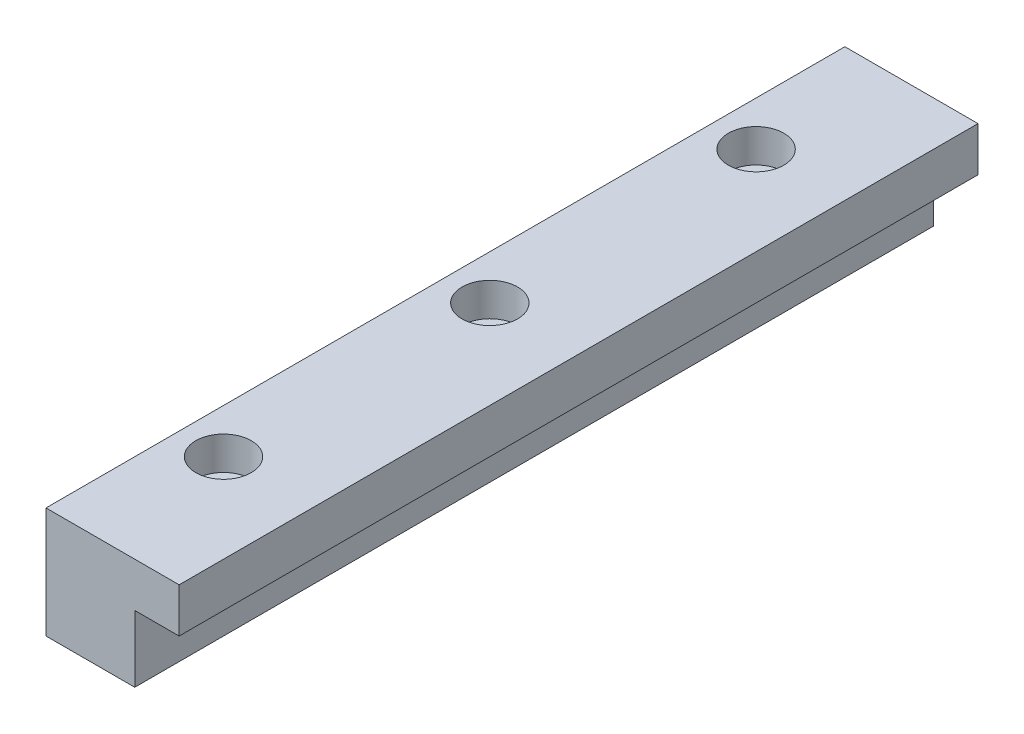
from build123d import *

# Parameters (mm, degrees)
EXTRUDE1_DEPTH                                    = 114.3
CBORE_FOR_5_8_SOCKET_HEAD_CAP_SCREW_E_D           = 10.0838
CBORE_FOR_5_8_SOCKET_HEAD_CAP_SCREW_E_CBORE_D     = 15.875
CBORE_FOR_5_8_SOCKET_HEAD_CAP_SCREW_E_CBORE_DEPTH = 9.525
CBORE_FOR_5_8_SOCKET_HEAD_CAP_SCREW_G_D           = 10.0838
CBORE_FOR_5_8_SOCKET_HEAD_CAP_SCREW_G_CBORE_D     = 15.875
CBORE_FOR_5_8_SOCKET_HEAD_CAP_SCREW_G_CBORE_DEPTH = 9.525
CBORE_FOR_5_8_SOCKET_HEAD_CAP_SCREW_K_D           = 10.0838
CBORE_FOR_5_8_SOCKET_HEAD_CAP_SCREW_K_CBORE_D     = 15.875
CBORE_FOR_5_8_SOCKET_HEAD_CAP_SCREW_K_CBORE_DEPTH = 9.525


with BuildPart() as part:
    # Sketch1 → Extrude1 (new, symmetric)
    with BuildSketch(Plane.XY):
        Polygon((-19.05, -15.875), (-19.05, 15.875), (19.05, 15.875), (19.05, 3.175), (6.35, 3.175), (6.35, -15.875), align=None)
    extrude(amount=EXTRUDE1_DEPTH, both=True)

    # CBORE for 5_8 Socket Head Cap Screw_E (through all)
    with Locations(Plane(origin=(-6.35, 15.875, 76.2), x_dir=(0, 0, 1), z_dir=(0, 1, 0))):
        with Locations((0, 0)):
            CounterBoreHole(CBORE_FOR_5_8_SOCKET_HEAD_CAP_SCREW_E_D / 2, CBORE_FOR_5_8_SOCKET_HEAD_CAP_SCREW_E_CBORE_D / 2, CBORE_FOR_5_8_SOCKET_HEAD_CAP_SCREW_E_CBORE_DEPTH)

    # CBORE for 5_8 Socket Head Cap Screw_G (through all)
    with Locations(Plane(origin=(-6.35, 15.875, 0), x_dir=(0, 0, 1), z_dir=(0, 1, 0))):
        with Locations((0, 0)):
            CounterBoreHole(CBORE_FOR_5_8_SOCKET_HEAD_CAP_SCREW_G_D / 2, CBORE_FOR_5_8_SOCKET_HEAD_CAP_SCREW_G_CBORE_D / 2, CBORE_FOR_5_8_SOCKET_HEAD_CAP_SCREW_G_CBORE_DEPTH)

    # CBORE for 5_8 Socket Head Cap Screw_K (through all)
    with Locations(Plane(origin=(-6.35, 15.875, -76.2), x_dir=(0, 0, 1), z_dir=(0, 1, 0))):
        with Locations((0, 0)):
            CounterBoreHole(CBORE_FOR_5_8_SOCKET_HEAD_CAP_SCREW_K_D / 2, CBORE_FOR_5_8_SOCKET_HEAD_CAP_SCREW_K_CBORE_D / 2, CBORE_FOR_5_8_SOCKET_HEAD_CAP_SCREW_K_CBORE_DEPTH)


solid = part.part
